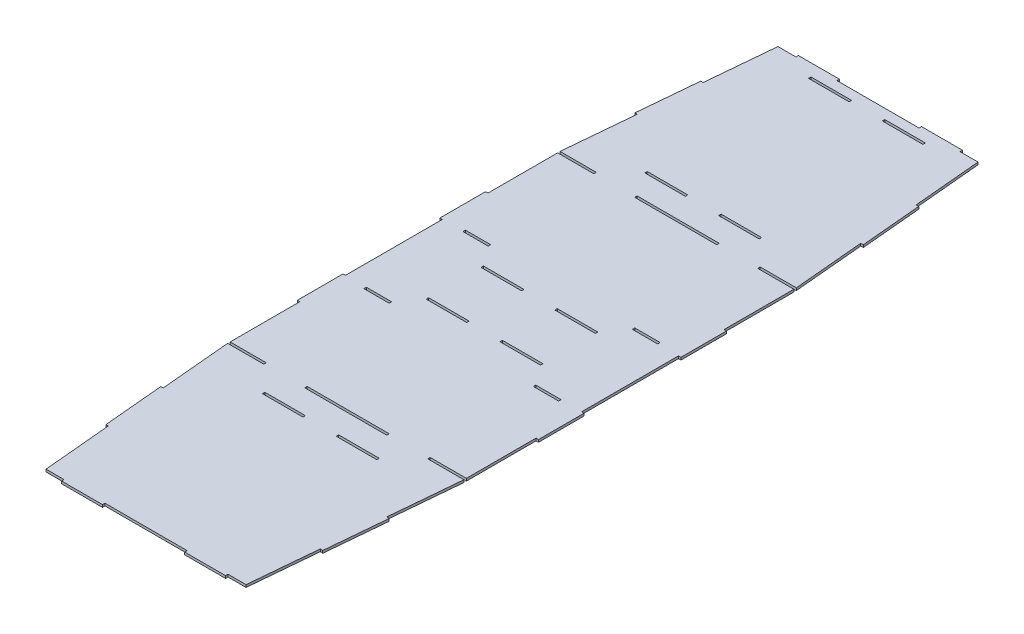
from build123d import *

# Parameters (mm, degrees)
SKETCH1_W           = 25.146006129
SKETCH1_H           = 1.524
SKETCH1_W_2         = 50.938311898
BOSS_EXTRUDE1_DEPTH = 1.524
SKETCH2_W           = 15.676902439
SKETCH2_H           = 1.524
CUT_EXTRUDE1_DEPTH  = 1.524


with BuildPart() as part:
    # Sketch1 → Boss-Extrude1 (new body)
    with BuildSketch(Plane(origin=(0, 0, 0), x_dir=(1, 0, 0), z_dir=(0, 1, 0))):
        Polygon((61.991176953, 0), (50.796387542, 0), (50.796387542, -1.524), (25.396387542, -1.524), (25.396387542, 0), (-25.541924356, 0), (-25.541924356, -1.524), (-50.941924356, -1.524), (-50.941924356, 0), (-62.136803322, 0), (-66.000368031, 42.580867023), (-67.480308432, 42.427652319), (-70.870738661, 79.949511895), (-69.404644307, 80.099854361), (-73.383558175, 123.952), (-50.941924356, 123.952), (-50.941924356, 125.476), (-73.360457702, 125.476), (-73.360457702, 168.71125536), (-74.884457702, 168.71125536), (-74.884457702, 197.062900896), (-73.360457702, 197.062900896), (-73.360457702, 257.089099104), (-74.884457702, 257.089099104), (-74.884457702, 285.44074464), (-73.360457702, 285.44074464), (-73.360457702, 328.676), (-50.941924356, 328.676), (-50.941924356, 330.2), (-73.383558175, 330.2), (-69.404644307, 374.052145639), (-70.870738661, 374.202488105), (-67.480308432, 411.724347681), (-66.000368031, 411.571132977), (-62.136803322, 454.152), (-50.941924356, 454.152), (-50.941924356, 455.676), (-25.541924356, 455.676), (-25.541924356, 454.152), (25.396387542, 454.152), (25.396387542, 455.676), (50.796387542, 455.676), (50.796387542, 454.152), (61.991176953, 454.152), (65.831437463, 411.848053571), (67.416804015, 411.991969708), (70.848299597, 374.190939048), (69.262933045, 374.04702291), (73.214920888, 330.19907657), (50.796387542, 330.2), (50.796387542, 328.676), (73.214920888, 328.676), (73.214920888, 285.44074464), (74.738920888, 285.44074464), (74.738920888, 257.089099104), (73.214920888, 257.089099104), (73.214920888, 197.062900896), (74.738920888, 197.062900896), (74.738920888, 168.71125536), (73.214920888, 168.71125536), (73.214920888, 125.476), (50.796387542, 125.476), (50.796387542, 123.952), (73.214920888, 123.95292343), (69.262933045, 80.10497709), (70.848299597, 79.961060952), (67.416804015, 42.160030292), (65.831437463, 42.303946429), align=None)
        with Locations((-22.9697038, 244.100799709)):
            Rectangle(SKETCH1_W, SKETCH1_H, mode=Mode.SUBTRACT)
        with Locations((-0.072768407, 124.714)):
            Rectangle(SKETCH1_W_2, SKETCH1_H, mode=Mode.SUBTRACT)
        with Locations((-0.072768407, 329.438)):
            Rectangle(SKETCH1_W_2, SKETCH1_H, mode=Mode.SUBTRACT)
        with Locations((22.824166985, 244.100799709)):
            Rectangle(SKETCH1_W, SKETCH1_H, mode=Mode.SUBTRACT)
        with Locations((22.824166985, 210.051200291)):
            Rectangle(SKETCH1_W, SKETCH1_H, mode=Mode.SUBTRACT)
        with Locations((-22.9697038, 210.051200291)):
            Rectangle(SKETCH1_W, SKETCH1_H, mode=Mode.SUBTRACT)
        with Locations((-22.9697038, 345.700799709)):
            Rectangle(SKETCH1_W, SKETCH1_H, mode=Mode.SUBTRACT)
        with Locations((22.824166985, 345.700799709)):
            Rectangle(SKETCH1_W, SKETCH1_H, mode=Mode.SUBTRACT)
        with Locations((-22.9697038, 447.300799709)):
            Rectangle(SKETCH1_W, SKETCH1_H, mode=Mode.SUBTRACT)
        with Locations((22.824166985, 447.300799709)):
            Rectangle(SKETCH1_W, SKETCH1_H, mode=Mode.SUBTRACT)
        with Locations((22.824166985, 108.451200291)):
            Rectangle(SKETCH1_W, SKETCH1_H, mode=Mode.SUBTRACT)
        with Locations((-22.9697038, 108.451200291)):
            Rectangle(SKETCH1_W, SKETCH1_H, mode=Mode.SUBTRACT)
    extrude(amount=BOSS_EXTRUDE1_DEPTH)

    # Sketch2 → Cut-Extrude1 (cut)
    with BuildSketch(Plane(origin=(0, 0, 0), x_dir=(-1, 0, 0), z_dir=(0, -1, 0))):
        with Locations((-52.488245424, 196.371526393)):
            Rectangle(SKETCH2_W, SKETCH2_H)
        with Locations((-52.488245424, 257.780473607)):
            Rectangle(SKETCH2_W, SKETCH2_H)
        with Locations((52.633782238, 257.780473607)):
            Rectangle(SKETCH2_W, SKETCH2_H)
        with Locations((52.633782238, 196.371526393)):
            Rectangle(SKETCH2_W, SKETCH2_H)
    extrude(amount=-CUT_EXTRUDE1_DEPTH, mode=Mode.SUBTRACT)


solid = part.part
